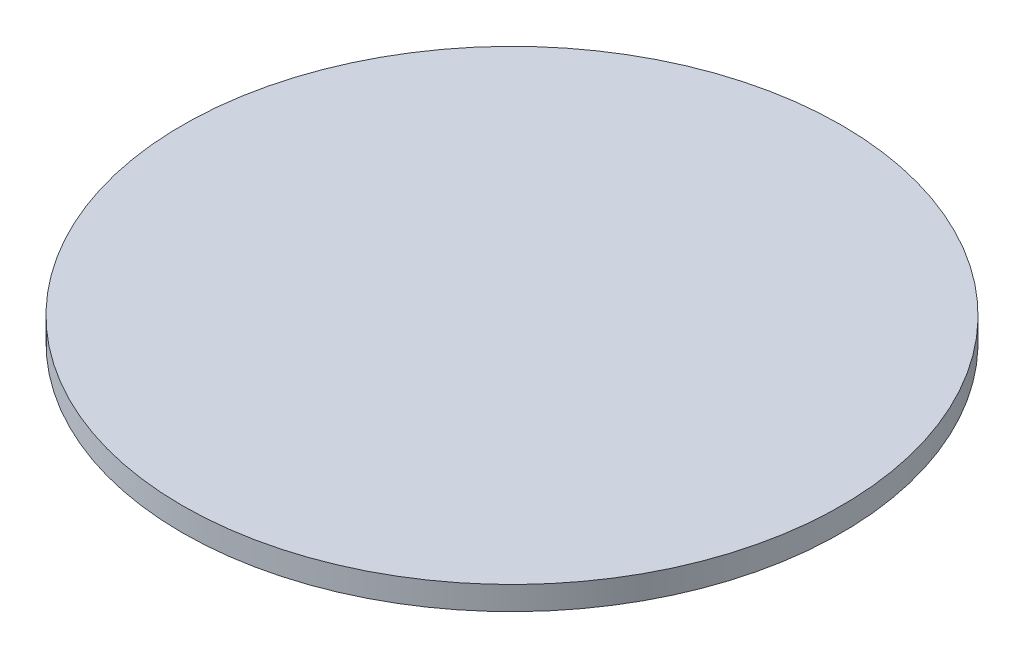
from build123d import *

# Parameters (mm, degrees)
SKETCH1_R           = 44.45
BOSS_EXTRUDE1_DEPTH = 3.175


with BuildPart() as part:
    # Sketch1 → Boss-Extrude1 (new body)
    with BuildSketch(Plane(origin=(0, 0, 0), x_dir=(1, 0, 0), z_dir=(0, 1, 0))):
        with Locations(Location((0, 0, 0), (0, 0, 270))):
            Circle(SKETCH1_R)
    extrude(amount=BOSS_EXTRUDE1_DEPTH)


solid = part.part
